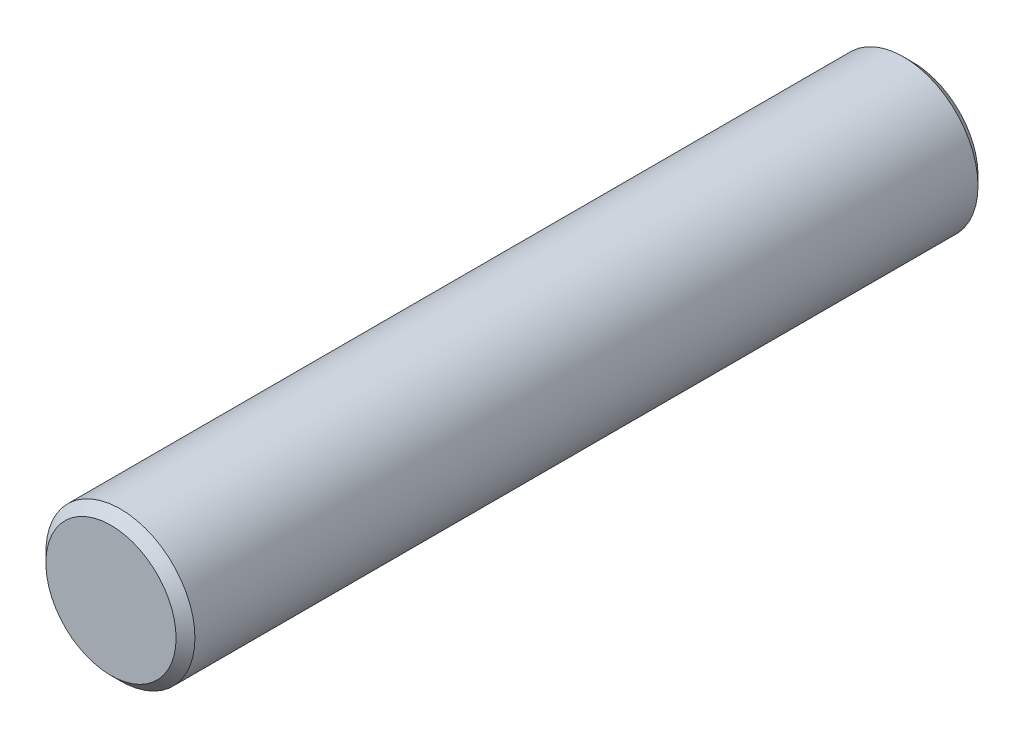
from build123d import *

# Parameters (mm, degrees)
SKETCH1_R                    = 0.79
DRIVE_SHAFT_PIN_SHAPE_DEPTH  = 8.5
DRIVE_SHAFT_PIN_CHAMFER_SIZE = 0.1


with BuildPart() as part:
    # Sketch1 → drive shaft pin shape (new body)
    with BuildSketch(Plane.XY):
        Circle(SKETCH1_R)
    extrude(amount=DRIVE_SHAFT_PIN_SHAPE_DEPTH)

    # drive shaft pin chamfer
    drive_shaft_pin_chamfer_edges = [part.edges().sort_by_distance(p)[0] for p in [
        (-0.79, 0, 0),
        (-0.79, 0, 8.5),
    ]]
    chamfer(drive_shaft_pin_chamfer_edges, length=DRIVE_SHAFT_PIN_CHAMFER_SIZE)


solid = part.part
